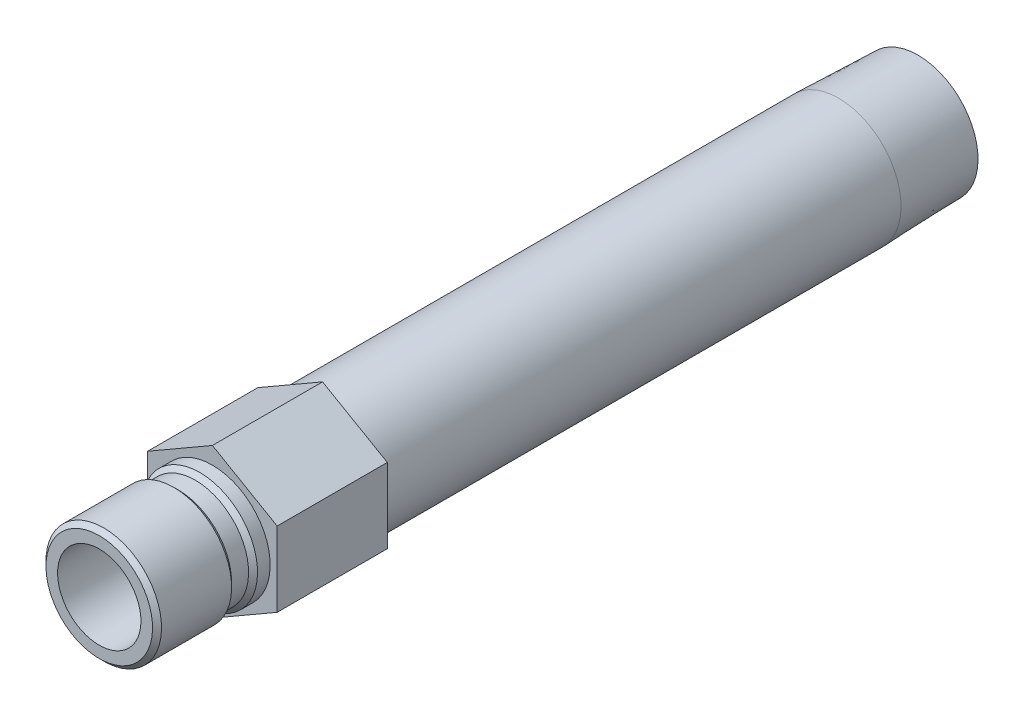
ISO-10303-21;
HEADER;
FILE_DESCRIPTION(('STEP AP214'),'2;1');
FILE_NAME('part.step','',(''),(''),'','','');
FILE_SCHEMA(('AUTOMOTIVE_DESIGN { 1 0 10303 214 1 1 1 1 }'));
ENDSEC;
DATA;
#1=APPLICATION_CONTEXT('core data for automotive mechanical design processes');
#2=APPLICATION_PROTOCOL_DEFINITION('international standard','automotive_design',2000,#1);
#3=PRODUCT_CONTEXT('',#1,'mechanical');
#4=PRODUCT('Part','Part','',(#3));
#5=PRODUCT_RELATED_PRODUCT_CATEGORY('part','',(#4));
#6=PRODUCT_DEFINITION_FORMATION('','',#4);
#7=PRODUCT_DEFINITION_CONTEXT('part definition',#1,'design');
#8=PRODUCT_DEFINITION('design','',#6,#7);
#9=PRODUCT_DEFINITION_SHAPE('','',#8);
#10=(LENGTH_UNIT() NAMED_UNIT(*) SI_UNIT(.MILLI.,.METRE.));
#11=(NAMED_UNIT(*) PLANE_ANGLE_UNIT() SI_UNIT($,.RADIAN.));
#12=(NAMED_UNIT(*) SI_UNIT($,.STERADIAN.) SOLID_ANGLE_UNIT());
#13=UNCERTAINTY_MEASURE_WITH_UNIT(LENGTH_MEASURE(1.E-05),#10,'distance_accuracy_value','');
#14=(GEOMETRIC_REPRESENTATION_CONTEXT(3) GLOBAL_UNCERTAINTY_ASSIGNED_CONTEXT((#13)) GLOBAL_UNIT_ASSIGNED_CONTEXT((#10,
#11,#12)) REPRESENTATION_CONTEXT('',''));
#15=CARTESIAN_POINT('',(0.,0.,0.));
#16=DIRECTION('',(0.,0.,1.));
#17=DIRECTION('',(1.,0.,0.));
#18=AXIS2_PLACEMENT_3D('',#15,#16,#17);
#19=CARTESIAN_POINT('',(0.,0.,0.));
#20=DIRECTION('',(0.,0.,-1.));
#21=DIRECTION('',(0.,1.,0.));
#22=AXIS2_PLACEMENT_3D('',#19,#20,#21);
#23=CYLINDRICAL_SURFACE('',#22,7.112);
#24=CARTESIAN_POINT('',(0.,0.,1.524));
#25=DIRECTION('',(0.,0.,-1.));
#26=DIRECTION('',(0.,1.,0.));
#27=AXIS2_PLACEMENT_3D('',#24,#25,#26);
#28=CIRCLE('',#27,7.112);
#29=CARTESIAN_POINT('',(0.,7.112,1.524));
#30=VERTEX_POINT('',#29);
#31=EDGE_CURVE('E147',#30,#30,#28,.T.);
#32=ORIENTED_EDGE('',*,*,#31,.T.);
#33=EDGE_LOOP('',(#32));
#34=FACE_BOUND('',#33,.T.);
#35=CARTESIAN_POINT('',(0.,0.,19.304));
#36=DIRECTION('',(0.,0.,-1.));
#37=DIRECTION('',(0.,1.,0.));
#38=AXIS2_PLACEMENT_3D('',#35,#36,#37);
#39=CIRCLE('',#38,7.112);
#40=CARTESIAN_POINT('',(0.,7.112,19.304));
#41=VERTEX_POINT('',#40);
#42=EDGE_CURVE('E42',#41,#41,#39,.T.);
#43=ORIENTED_EDGE('',*,*,#42,.F.);
#44=EDGE_LOOP('',(#43));
#45=FACE_BOUND('',#44,.T.);
#46=ADVANCED_FACE('F33',(#34,#45),#23,.F.);
#47=CARTESIAN_POINT('',(0.,7.112,19.304));
#48=DIRECTION('',(0.,0.,1.));
#49=DIRECTION('',(0.,-1.,0.));
#50=AXIS2_PLACEMENT_3D('',#47,#48,#49);
#51=PLANE('',#50);
#52=ORIENTED_EDGE('',*,*,#42,.T.);
#53=EDGE_LOOP('',(#52));
#54=FACE_BOUND('',#53,.T.);
#55=CARTESIAN_POINT('',(0.,0.,19.304));
#56=DIRECTION('',(0.,0.,-1.));
#57=DIRECTION('',(0.,1.,0.));
#58=AXIS2_PLACEMENT_3D('',#55,#56,#57);
#59=CIRCLE('',#58,9.0932);
#60=CARTESIAN_POINT('',(0.,9.0932,19.304));
#61=VERTEX_POINT('',#60);
#62=EDGE_CURVE('E180',#61,#61,#59,.T.);
#63=ORIENTED_EDGE('',*,*,#62,.F.);
#64=EDGE_LOOP('',(#63));
#65=FACE_BOUND('',#64,.T.);
#66=ADVANCED_FACE('F186',(#54,#65),#51,.T.);
#67=CARTESIAN_POINT('',(0.,0.,18.542));
#68=DIRECTION('',(0.,0.,-1.));
#69=DIRECTION('',(0.,1.,0.));
#70=AXIS2_PLACEMENT_3D('',#67,#68,#69);
#71=CONICAL_SURFACE('',#70,9.8552,0.785398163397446);
#72=ORIENTED_EDGE('',*,*,#62,.T.);
#73=EDGE_LOOP('',(#72));
#74=FACE_BOUND('',#73,.T.);
#75=CARTESIAN_POINT('',(0.,0.,18.542));
#76=DIRECTION('',(0.,0.,-1.));
#77=DIRECTION('',(0.,1.,0.));
#78=AXIS2_PLACEMENT_3D('',#75,#76,#77);
#79=CIRCLE('',#78,9.8552);
#80=CARTESIAN_POINT('',(0.,9.8552,18.542));
#81=VERTEX_POINT('',#80);
#82=EDGE_CURVE('E177',#81,#81,#79,.T.);
#83=ORIENTED_EDGE('',*,*,#82,.F.);
#84=EDGE_LOOP('',(#83));
#85=FACE_BOUND('',#84,.T.);
#86=ADVANCED_FACE('F194',(#74,#85),#71,.T.);
#87=CARTESIAN_POINT('',(0.,0.,0.));
#88=DIRECTION('',(0.,0.,-1.));
#89=DIRECTION('',(0.,1.,0.));
#90=AXIS2_PLACEMENT_3D('',#87,#88,#89);
#91=CYLINDRICAL_SURFACE('',#90,9.8552);
#92=ORIENTED_EDGE('',*,*,#82,.T.);
#93=EDGE_LOOP('',(#92));
#94=FACE_BOUND('',#93,.T.);
#95=CARTESIAN_POINT('',(0.,0.,6.5786));
#96=DIRECTION('',(0.,0.,-1.));
#97=DIRECTION('',(0.,1.,0.));
#98=AXIS2_PLACEMENT_3D('',#95,#96,#97);
#99=CIRCLE('',#98,9.8552);
#100=CARTESIAN_POINT('',(0.,9.8552,6.5786));
#101=VERTEX_POINT('',#100);
#102=EDGE_CURVE('E174',#101,#101,#99,.T.);
#103=ORIENTED_EDGE('',*,*,#102,.F.);
#104=EDGE_LOOP('',(#103));
#105=FACE_BOUND('',#104,.T.);
#106=ADVANCED_FACE('F249',(#94,#105),#91,.T.);
#107=CARTESIAN_POINT('',(0.,0.,5.8166));
#108=DIRECTION('',(0.,0.,1.));
#109=DIRECTION('',(0.,-1.,0.));
#110=AXIS2_PLACEMENT_3D('',#107,#108,#109);
#111=CONICAL_SURFACE('',#110,9.0932,0.785398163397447);
#112=ORIENTED_EDGE('',*,*,#102,.T.);
#113=EDGE_LOOP('',(#112));
#114=FACE_BOUND('',#113,.T.);
#115=CARTESIAN_POINT('',(0.,0.,5.8166));
#116=DIRECTION('',(0.,0.,-1.));
#117=DIRECTION('',(0.,1.,0.));
#118=AXIS2_PLACEMENT_3D('',#115,#116,#117);
#119=CIRCLE('',#118,9.0932);
#120=CARTESIAN_POINT('',(0.,9.0932,5.8166));
#121=VERTEX_POINT('',#120);
#122=EDGE_CURVE('E171',#121,#121,#119,.T.);
#123=ORIENTED_EDGE('',*,*,#122,.F.);
#124=EDGE_LOOP('',(#123));
#125=FACE_BOUND('',#124,.T.);
#126=ADVANCED_FACE('F245',(#114,#125),#111,.T.);
#127=CARTESIAN_POINT('',(0.,0.,0.));
#128=DIRECTION('',(0.,0.,-1.));
#129=DIRECTION('',(0.,1.,0.));
#130=AXIS2_PLACEMENT_3D('',#127,#128,#129);
#131=CYLINDRICAL_SURFACE('',#130,9.0932);
#132=ORIENTED_EDGE('',*,*,#122,.T.);
#133=EDGE_LOOP('',(#132));
#134=FACE_BOUND('',#133,.T.);
#135=CARTESIAN_POINT('',(0.,0.,2.921));
#136=DIRECTION('',(0.,0.,-1.));
#137=DIRECTION('',(0.,1.,0.));
#138=AXIS2_PLACEMENT_3D('',#135,#136,#137);
#139=CIRCLE('',#138,9.0932);
#140=CARTESIAN_POINT('',(0.,9.0932,2.921));
#141=VERTEX_POINT('',#140);
#142=EDGE_CURVE('E168',#141,#141,#139,.T.);
#143=ORIENTED_EDGE('',*,*,#142,.F.);
#144=EDGE_LOOP('',(#143));
#145=FACE_BOUND('',#144,.T.);
#146=ADVANCED_FACE('F241',(#134,#145),#131,.T.);
#147=CARTESIAN_POINT('',(0.,0.,2.159));
#148=DIRECTION('',(0.,0.,-1.));
#149=DIRECTION('',(0.,1.,0.));
#150=AXIS2_PLACEMENT_3D('',#147,#148,#149);
#151=CONICAL_SURFACE('',#150,9.8552,0.785398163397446);
#152=ORIENTED_EDGE('',*,*,#142,.T.);
#153=EDGE_LOOP('',(#152));
#154=FACE_BOUND('',#153,.T.);
#155=CARTESIAN_POINT('',(0.,0.,2.159));
#156=DIRECTION('',(0.,0.,-1.));
#157=DIRECTION('',(0.,1.,0.));
#158=AXIS2_PLACEMENT_3D('',#155,#156,#157);
#159=CIRCLE('',#158,9.8552);
#160=CARTESIAN_POINT('',(0.,9.8552,2.159));
#161=VERTEX_POINT('',#160);
#162=EDGE_CURVE('E165',#161,#161,#159,.T.);
#163=ORIENTED_EDGE('',*,*,#162,.F.);
#164=EDGE_LOOP('',(#163));
#165=FACE_BOUND('',#164,.T.);
#166=ADVANCED_FACE('F237',(#154,#165),#151,.T.);
#167=CARTESIAN_POINT('',(0.,0.,0.));
#168=DIRECTION('',(0.,0.,-1.));
#169=DIRECTION('',(0.,1.,0.));
#170=AXIS2_PLACEMENT_3D('',#167,#168,#169);
#171=CYLINDRICAL_SURFACE('',#170,9.8552);
#172=ORIENTED_EDGE('',*,*,#162,.T.);
#173=EDGE_LOOP('',(#172));
#174=FACE_BOUND('',#173,.T.);
#175=CARTESIAN_POINT('',(0.,0.,0.));
#176=DIRECTION('',(0.,0.,-1.));
#177=DIRECTION('',(0.,1.,0.));
#178=AXIS2_PLACEMENT_3D('',#175,#176,#177);
#179=CIRCLE('',#178,9.8552);
#180=CARTESIAN_POINT('',(0.,9.8552,0.));
#181=VERTEX_POINT('',#180);
#182=EDGE_CURVE('E162',#181,#181,#179,.T.);
#183=ORIENTED_EDGE('',*,*,#182,.F.);
#184=EDGE_LOOP('',(#183));
#185=FACE_BOUND('',#184,.T.);
#186=ADVANCED_FACE('F233',(#174,#185),#171,.T.);
#187=CARTESIAN_POINT('',(0.,9.8552,0.));
#188=DIRECTION('',(0.,0.,1.));
#189=DIRECTION('',(0.,-1.,0.));
#190=AXIS2_PLACEMENT_3D('',#187,#188,#189);
#191=PLANE('',#190);
#192=ORIENTED_EDGE('',*,*,#182,.T.);
#193=EDGE_LOOP('',(#192));
#194=FACE_BOUND('',#193,.T.);
#195=DIRECTION('',(-0.866025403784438,-0.5,0.));
#196=VECTOR('',#195,1.);
#197=CARTESIAN_POINT('',(0.,12.7582862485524,0.));
#198=LINE('',#197,#196);
#199=CARTESIAN_POINT('',(0.,12.7582862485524,0.));
#200=VERTEX_POINT('',#199);
#201=CARTESIAN_POINT('',(-11.049,6.37914312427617,0.));
#202=VERTEX_POINT('',#201);
#203=EDGE_CURVE('E121',#200,#202,#198,.T.);
#204=ORIENTED_EDGE('',*,*,#203,.T.);
#205=DIRECTION('',(0.,-1.,0.));
#206=VECTOR('',#205,1.);
#207=CARTESIAN_POINT('',(-11.049,6.37914312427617,0.));
#208=LINE('',#207,#206);
#209=CARTESIAN_POINT('',(-11.049,-6.37914312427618,0.));
#210=VERTEX_POINT('',#209);
#211=EDGE_CURVE('E124',#202,#210,#208,.T.);
#212=ORIENTED_EDGE('',*,*,#211,.T.);
#213=DIRECTION('',(0.866025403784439,-0.5,0.));
#214=VECTOR('',#213,1.);
#215=CARTESIAN_POINT('',(-11.049,-6.37914312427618,0.));
#216=LINE('',#215,#214);
#217=CARTESIAN_POINT('',(0.,-12.7582862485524,0.));
#218=VERTEX_POINT('',#217);
#219=EDGE_CURVE('E128',#210,#218,#216,.T.);
#220=ORIENTED_EDGE('',*,*,#219,.T.);
#221=DIRECTION('',(0.866025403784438,0.5,0.));
#222=VECTOR('',#221,1.);
#223=CARTESIAN_POINT('',(0.,-12.7582862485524,0.));
#224=LINE('',#223,#222);
#225=CARTESIAN_POINT('',(11.049,-6.37914312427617,0.));
#226=VERTEX_POINT('',#225);
#227=EDGE_CURVE('E131',#218,#226,#224,.T.);
#228=ORIENTED_EDGE('',*,*,#227,.T.);
#229=DIRECTION('',(0.,1.,0.));
#230=VECTOR('',#229,1.);
#231=CARTESIAN_POINT('',(11.049,-6.37914312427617,0.));
#232=LINE('',#231,#230);
#233=CARTESIAN_POINT('',(11.049,6.37914312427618,0.));
#234=VERTEX_POINT('',#233);
#235=EDGE_CURVE('E98',#226,#234,#232,.T.);
#236=ORIENTED_EDGE('',*,*,#235,.T.);
#237=DIRECTION('',(-0.866025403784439,0.5,0.));
#238=VECTOR('',#237,1.);
#239=CARTESIAN_POINT('',(11.049,6.37914312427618,0.));
#240=LINE('',#239,#238);
#241=EDGE_CURVE('E134',#234,#200,#240,.T.);
#242=ORIENTED_EDGE('',*,*,#241,.T.);
#243=EDGE_LOOP('',(#204,#212,#220,#228,#236,#242));
#244=FACE_BOUND('',#243,.T.);
#245=ADVANCED_FACE('F210',(#194,#244),#191,.T.);
#246=CARTESIAN_POINT('',(0.,0.,0.));
#247=DIRECTION('',(0.,0.,-1.));
#248=DIRECTION('',(0.,1.,0.));
#249=AXIS2_PLACEMENT_3D('',#246,#247,#248);
#250=CYLINDRICAL_SURFACE('',#249,7.89939999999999);
#251=CARTESIAN_POINT('',(0.,0.,0.));
#252=DIRECTION('',(0.,0.,1.));
#253=DIRECTION('',(1.,0.,0.));
#254=AXIS2_PLACEMENT_3D('',#251,#252,#253);
#255=CIRCLE('',#254,7.89939999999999);
#256=CARTESIAN_POINT('',(7.89939999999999,0.,0.));
#257=VERTEX_POINT('',#256);
#258=EDGE_CURVE('E11',#257,#257,#255,.T.);
#259=ORIENTED_EDGE('',*,*,#258,.F.);
#260=EDGE_LOOP('',(#259));
#261=FACE_BOUND('',#260,.T.);
#262=CARTESIAN_POINT('',(0.,0.,1.10533199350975));
#263=DIRECTION('',(0.,0.,-1.));
#264=DIRECTION('',(0.,1.,0.));
#265=AXIS2_PLACEMENT_3D('',#262,#263,#264);
#266=CIRCLE('',#265,7.8994);
#267=CARTESIAN_POINT('',(0.,7.8994,1.10533199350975));
#268=VERTEX_POINT('',#267);
#269=EDGE_CURVE('E150',#268,#268,#266,.T.);
#270=ORIENTED_EDGE('',*,*,#269,.F.);
#271=EDGE_LOOP('',(#270));
#272=FACE_BOUND('',#271,.T.);
#273=ADVANCED_FACE('F200',(#261,#272),#250,.F.);
#274=CARTESIAN_POINT('',(0.,0.,1.524));
#275=DIRECTION('',(0.,0.,-1.));
#276=DIRECTION('',(0.,1.,0.));
#277=AXIS2_PLACEMENT_3D('',#274,#275,#276);
#278=CONICAL_SURFACE('',#277,7.112,1.08210413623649);
#279=ORIENTED_EDGE('',*,*,#269,.T.);
#280=EDGE_LOOP('',(#279));
#281=FACE_BOUND('',#280,.T.);
#282=ORIENTED_EDGE('',*,*,#31,.F.);
#283=EDGE_LOOP('',(#282));
#284=FACE_BOUND('',#283,.T.);
#285=ADVANCED_FACE('F197',(#281,#284),#278,.F.);
#286=CARTESIAN_POINT('',(-11.049,6.37914312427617,-18.796));
#287=DIRECTION('',(0.,0.,1.));
#288=DIRECTION('',(1.,0.,0.));
#289=AXIS2_PLACEMENT_3D('',#286,#287,#288);
#290=PLANE('',#289);
#291=CARTESIAN_POINT('',(0.,0.,-18.796));
#292=DIRECTION('',(0.,0.,1.));
#293=DIRECTION('',(1.,0.,0.));
#294=AXIS2_PLACEMENT_3D('',#291,#292,#293);
#295=CIRCLE('',#294,7.89939999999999);
#296=CARTESIAN_POINT('',(7.89939999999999,0.,-18.796));
#297=VERTEX_POINT('',#296);
#298=EDGE_CURVE('E36',#297,#297,#295,.T.);
#299=ORIENTED_EDGE('',*,*,#298,.F.);
#300=EDGE_LOOP('',(#299));
#301=FACE_BOUND('',#300,.T.);
#302=CARTESIAN_POINT('',(0.,0.,-18.796));
#303=DIRECTION('',(0.,0.,1.));
#304=DIRECTION('',(1.,0.,0.));
#305=AXIS2_PLACEMENT_3D('',#302,#303,#304);
#306=CIRCLE('',#305,7.112);
#307=CARTESIAN_POINT('',(7.112,0.,-18.796));
#308=VERTEX_POINT('',#307);
#309=EDGE_CURVE('E125',#308,#308,#306,.T.);
#310=ORIENTED_EDGE('',*,*,#309,.T.);
#311=EDGE_LOOP('',(#310));
#312=FACE_BOUND('',#311,.T.);
#313=ADVANCED_FACE('F199',(#301,#312),#290,.F.);
#314=CARTESIAN_POINT('',(0.,0.,-18.796));
#315=DIRECTION('',(0.,0.,1.));
#316=DIRECTION('',(1.,0.,0.));
#317=AXIS2_PLACEMENT_3D('',#314,#315,#316);
#318=CYLINDRICAL_SURFACE('',#317,7.112);
#319=ORIENTED_EDGE('',*,*,#309,.F.);
#320=EDGE_LOOP('',(#319));
#321=FACE_BOUND('',#320,.T.);
#322=CARTESIAN_POINT('',(0.,0.,0.));
#323=DIRECTION('',(0.,0.,1.));
#324=DIRECTION('',(1.,0.,0.));
#325=AXIS2_PLACEMENT_3D('',#322,#323,#324);
#326=CIRCLE('',#325,7.112);
#327=CARTESIAN_POINT('',(7.112,0.,0.));
#328=VERTEX_POINT('',#327);
#329=EDGE_CURVE('E443',#328,#328,#326,.T.);
#330=ORIENTED_EDGE('',*,*,#329,.T.);
#331=EDGE_LOOP('',(#330));
#332=FACE_BOUND('',#331,.T.);
#333=ADVANCED_FACE('F207',(#321,#332),#318,.F.);
#334=CARTESIAN_POINT('',(-11.049,6.37914312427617,0.));
#335=DIRECTION('',(0.,0.,1.));
#336=DIRECTION('',(1.,0.,0.));
#337=AXIS2_PLACEMENT_3D('',#334,#335,#336);
#338=PLANE('',#337);
#339=ORIENTED_EDGE('',*,*,#258,.T.);
#340=EDGE_LOOP('',(#339));
#341=FACE_BOUND('',#340,.T.);
#342=ORIENTED_EDGE('',*,*,#329,.F.);
#343=EDGE_LOOP('',(#342));
#344=FACE_BOUND('',#343,.T.);
#345=ADVANCED_FACE('F221',(#341,#344),#338,.T.);
#346=CARTESIAN_POINT('',(0.,10.244140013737,-120.396));
#347=DIRECTION('',(0.,0.,-1.));
#348=DIRECTION('',(0.,1.,0.));
#349=AXIS2_PLACEMENT_3D('',#346,#347,#348);
#350=PLANE('',#349);
#351=CARTESIAN_POINT('',(0.,0.,-120.396));
#352=DIRECTION('',(0.,0.,-1.));
#353=DIRECTION('',(0.,1.,0.));
#354=AXIS2_PLACEMENT_3D('',#351,#352,#353);
#355=CIRCLE('',#354,10.244140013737);
#356=CARTESIAN_POINT('',(0.,10.244140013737,-120.396));
#357=VERTEX_POINT('',#356);
#358=EDGE_CURVE('E156',#357,#357,#355,.T.);
#359=ORIENTED_EDGE('',*,*,#358,.T.);
#360=EDGE_LOOP('',(#359));
#361=FACE_BOUND('',#360,.T.);
#362=CARTESIAN_POINT('',(0.,0.,-120.396));
#363=DIRECTION('',(0.,0.,-1.));
#364=DIRECTION('',(0.,1.,0.));
#365=AXIS2_PLACEMENT_3D('',#362,#363,#364);
#366=CIRCLE('',#365,7.89939999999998);
#367=CARTESIAN_POINT('',(0.,7.8994,-120.396));
#368=VERTEX_POINT('',#367);
#369=EDGE_CURVE('E153',#368,#368,#366,.T.);
#370=ORIENTED_EDGE('',*,*,#369,.F.);
#371=EDGE_LOOP('',(#370));
#372=FACE_BOUND('',#371,.T.);
#373=ADVANCED_FACE('F218',(#361,#372),#350,.T.);
#374=ORIENTED_EDGE('',*,*,#369,.T.);
#375=EDGE_LOOP('',(#374));
#376=FACE_BOUND('',#375,.T.);
#377=ORIENTED_EDGE('',*,*,#298,.T.);
#378=EDGE_LOOP('',(#377));
#379=FACE_BOUND('',#378,.T.);
#380=ADVANCED_FACE('F213',(#376,#379),#250,.F.);
#381=CARTESIAN_POINT('',(0.,0.,-120.396));
#382=DIRECTION('',(0.,0.,1.));
#383=DIRECTION('',(0.,-1.,0.));
#384=AXIS2_PLACEMENT_3D('',#381,#382,#383);
#385=CONICAL_SURFACE('',#384,10.244140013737,0.0312396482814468);
#386=CARTESIAN_POINT('',(0.,0.,-106.8324));
#387=DIRECTION('',(0.,0.,-1.));
#388=DIRECTION('',(0.,1.,0.));
#389=AXIS2_PLACEMENT_3D('',#386,#387,#388);
#390=CIRCLE('',#389,10.668);
#391=CARTESIAN_POINT('',(0.,10.668,-106.8324));
#392=VERTEX_POINT('',#391);
#393=EDGE_CURVE('E159',#392,#392,#390,.T.);
#394=ORIENTED_EDGE('',*,*,#393,.T.);
#395=EDGE_LOOP('',(#394));
#396=FACE_BOUND('',#395,.T.);
#397=ORIENTED_EDGE('',*,*,#358,.F.);
#398=EDGE_LOOP('',(#397));
#399=FACE_BOUND('',#398,.T.);
#400=ADVANCED_FACE('F223',(#396,#399),#385,.T.);
#401=CARTESIAN_POINT('',(0.,0.,0.));
#402=DIRECTION('',(0.,0.,-1.));
#403=DIRECTION('',(0.,1.,0.));
#404=AXIS2_PLACEMENT_3D('',#401,#402,#403);
#405=CYLINDRICAL_SURFACE('',#404,10.668);
#406=ORIENTED_EDGE('',*,*,#393,.F.);
#407=EDGE_LOOP('',(#406));
#408=FACE_BOUND('',#407,.T.);
#409=CARTESIAN_POINT('',(0.,0.,-18.796));
#410=DIRECTION('',(0.,0.,1.));
#411=DIRECTION('',(1.,0.,0.));
#412=AXIS2_PLACEMENT_3D('',#409,#410,#411);
#413=CIRCLE('',#412,10.668);
#414=CARTESIAN_POINT('',(10.668,0.,-18.796));
#415=VERTEX_POINT('',#414);
#416=EDGE_CURVE('E144',#415,#415,#413,.F.);
#417=ORIENTED_EDGE('',*,*,#416,.T.);
#418=EDGE_LOOP('',(#417));
#419=FACE_BOUND('',#418,.T.);
#420=ADVANCED_FACE('F226',(#408,#419),#405,.T.);
#421=ORIENTED_EDGE('',*,*,#416,.F.);
#422=EDGE_LOOP('',(#421));
#423=FACE_BOUND('',#422,.T.);
#424=DIRECTION('',(-0.866025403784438,-0.5,0.));
#425=VECTOR('',#424,1.);
#426=CARTESIAN_POINT('',(0.,12.7582862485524,-18.796));
#427=LINE('',#426,#425);
#428=CARTESIAN_POINT('',(0.,12.7582862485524,-18.796));
#429=VERTEX_POINT('',#428);
#430=CARTESIAN_POINT('',(-11.049,6.37914312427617,-18.796));
#431=VERTEX_POINT('',#430);
#432=EDGE_CURVE('E137',#429,#431,#427,.T.);
#433=ORIENTED_EDGE('',*,*,#432,.F.);
#434=DIRECTION('',(-0.866025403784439,0.5,0.));
#435=VECTOR('',#434,1.);
#436=CARTESIAN_POINT('',(11.049,6.37914312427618,-18.796));
#437=LINE('',#436,#435);
#438=CARTESIAN_POINT('',(11.049,6.37914312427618,-18.796));
#439=VERTEX_POINT('',#438);
#440=EDGE_CURVE('E111',#439,#429,#437,.T.);
#441=ORIENTED_EDGE('',*,*,#440,.F.);
#442=DIRECTION('',(0.,1.,0.));
#443=VECTOR('',#442,1.);
#444=CARTESIAN_POINT('',(11.049,-6.37914312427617,-18.796));
#445=LINE('',#444,#443);
#446=CARTESIAN_POINT('',(11.049,-6.37914312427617,-18.796));
#447=VERTEX_POINT('',#446);
#448=EDGE_CURVE('E96',#447,#439,#445,.T.);
#449=ORIENTED_EDGE('',*,*,#448,.F.);
#450=DIRECTION('',(0.866025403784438,0.5,0.));
#451=VECTOR('',#450,1.);
#452=CARTESIAN_POINT('',(0.,-12.7582862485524,-18.796));
#453=LINE('',#452,#451);
#454=CARTESIAN_POINT('',(0.,-12.7582862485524,-18.796));
#455=VERTEX_POINT('',#454);
#456=EDGE_CURVE('E109',#455,#447,#453,.T.);
#457=ORIENTED_EDGE('',*,*,#456,.F.);
#458=DIRECTION('',(0.866025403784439,-0.5,0.));
#459=VECTOR('',#458,1.);
#460=CARTESIAN_POINT('',(-11.049,-6.37914312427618,-18.796));
#461=LINE('',#460,#459);
#462=CARTESIAN_POINT('',(-11.049,-6.37914312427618,-18.796));
#463=VERTEX_POINT('',#462);
#464=EDGE_CURVE('E114',#463,#455,#461,.T.);
#465=ORIENTED_EDGE('',*,*,#464,.F.);
#466=DIRECTION('',(0.,-1.,0.));
#467=VECTOR('',#466,1.);
#468=CARTESIAN_POINT('',(-11.049,6.37914312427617,-18.796));
#469=LINE('',#468,#467);
#470=EDGE_CURVE('E116',#431,#463,#469,.T.);
#471=ORIENTED_EDGE('',*,*,#470,.F.);
#472=EDGE_LOOP('',(#433,#441,#449,#457,#465,#471));
#473=FACE_BOUND('',#472,.T.);
#474=ADVANCED_FACE('F107',(#423,#473),#290,.F.);
#475=CARTESIAN_POINT('',(0.,12.7582862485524,-18.796));
#476=DIRECTION('',(-0.5,0.866025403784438,0.));
#477=DIRECTION('',(-0.866025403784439,-0.5,0.));
#478=AXIS2_PLACEMENT_3D('',#475,#476,#477);
#479=PLANE('',#478);
#480=ORIENTED_EDGE('',*,*,#203,.F.);
#481=DIRECTION('',(0.,0.,1.));
#482=VECTOR('',#481,1.);
#483=CARTESIAN_POINT('',(0.,12.7582862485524,-18.796));
#484=LINE('',#483,#482);
#485=EDGE_CURVE('E50',#429,#200,#484,.T.);
#486=ORIENTED_EDGE('',*,*,#485,.F.);
#487=ORIENTED_EDGE('',*,*,#432,.T.);
#488=DIRECTION('',(0.,0.,1.));
#489=VECTOR('',#488,1.);
#490=CARTESIAN_POINT('',(-11.049,6.37914312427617,-18.796));
#491=LINE('',#490,#489);
#492=EDGE_CURVE('E85',#431,#202,#491,.T.);
#493=ORIENTED_EDGE('',*,*,#492,.T.);
#494=EDGE_LOOP('',(#480,#486,#487,#493));
#495=FACE_BOUND('',#494,.T.);
#496=ADVANCED_FACE('F215',(#495),#479,.T.);
#497=CARTESIAN_POINT('',(11.049,6.37914312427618,-18.796));
#498=DIRECTION('',(0.5,0.866025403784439,0.));
#499=DIRECTION('',(-0.866025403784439,0.5,0.));
#500=AXIS2_PLACEMENT_3D('',#497,#498,#499);
#501=PLANE('',#500);
#502=ORIENTED_EDGE('',*,*,#241,.F.);
#503=DIRECTION('',(0.,0.,1.));
#504=VECTOR('',#503,1.);
#505=CARTESIAN_POINT('',(11.049,6.37914312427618,-18.796));
#506=LINE('',#505,#504);
#507=EDGE_CURVE('E73',#439,#234,#506,.T.);
#508=ORIENTED_EDGE('',*,*,#507,.F.);
#509=ORIENTED_EDGE('',*,*,#440,.T.);
#510=ORIENTED_EDGE('',*,*,#485,.T.);
#511=EDGE_LOOP('',(#502,#508,#509,#510));
#512=FACE_BOUND('',#511,.T.);
#513=ADVANCED_FACE('F276',(#512),#501,.T.);
#514=CARTESIAN_POINT('',(11.049,-6.37914312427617,-18.796));
#515=DIRECTION('',(1.,0.,0.));
#516=DIRECTION('',(0.,1.,0.));
#517=AXIS2_PLACEMENT_3D('',#514,#515,#516);
#518=PLANE('',#517);
#519=ORIENTED_EDGE('',*,*,#235,.F.);
#520=DIRECTION('',(0.,0.,1.));
#521=VECTOR('',#520,1.);
#522=CARTESIAN_POINT('',(11.049,-6.37914312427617,-18.796));
#523=LINE('',#522,#521);
#524=EDGE_CURVE('E93',#447,#226,#523,.T.);
#525=ORIENTED_EDGE('',*,*,#524,.F.);
#526=ORIENTED_EDGE('',*,*,#448,.T.);
#527=ORIENTED_EDGE('',*,*,#507,.T.);
#528=EDGE_LOOP('',(#519,#525,#526,#527));
#529=FACE_BOUND('',#528,.T.);
#530=ADVANCED_FACE('F95',(#529),#518,.T.);
#531=CARTESIAN_POINT('',(0.,-12.7582862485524,-18.796));
#532=DIRECTION('',(0.5,-0.866025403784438,0.));
#533=DIRECTION('',(0.866025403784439,0.5,0.));
#534=AXIS2_PLACEMENT_3D('',#531,#532,#533);
#535=PLANE('',#534);
#536=ORIENTED_EDGE('',*,*,#227,.F.);
#537=DIRECTION('',(0.,0.,1.));
#538=VECTOR('',#537,1.);
#539=CARTESIAN_POINT('',(0.,-12.7582862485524,-18.796));
#540=LINE('',#539,#538);
#541=EDGE_CURVE('E103',#455,#218,#540,.T.);
#542=ORIENTED_EDGE('',*,*,#541,.F.);
#543=ORIENTED_EDGE('',*,*,#456,.T.);
#544=ORIENTED_EDGE('',*,*,#524,.T.);
#545=EDGE_LOOP('',(#536,#542,#543,#544));
#546=FACE_BOUND('',#545,.T.);
#547=ADVANCED_FACE('F113',(#546),#535,.T.);
#548=CARTESIAN_POINT('',(-11.049,-6.37914312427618,-18.796));
#549=DIRECTION('',(-0.5,-0.866025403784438,0.));
#550=DIRECTION('',(0.866025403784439,-0.5,0.));
#551=AXIS2_PLACEMENT_3D('',#548,#549,#550);
#552=PLANE('',#551);
#553=ORIENTED_EDGE('',*,*,#219,.F.);
#554=DIRECTION('',(0.,0.,1.));
#555=VECTOR('',#554,1.);
#556=CARTESIAN_POINT('',(-11.049,-6.37914312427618,-18.796));
#557=LINE('',#556,#555);
#558=EDGE_CURVE('E141',#463,#210,#557,.T.);
#559=ORIENTED_EDGE('',*,*,#558,.F.);
#560=ORIENTED_EDGE('',*,*,#464,.T.);
#561=ORIENTED_EDGE('',*,*,#541,.T.);
#562=EDGE_LOOP('',(#553,#559,#560,#561));
#563=FACE_BOUND('',#562,.T.);
#564=ADVANCED_FACE('F275',(#563),#552,.T.);
#565=CARTESIAN_POINT('',(-11.049,6.37914312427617,-18.796));
#566=DIRECTION('',(-1.,0.,0.));
#567=DIRECTION('',(0.,0.,1.));
#568=AXIS2_PLACEMENT_3D('',#565,#566,#567);
#569=PLANE('',#568);
#570=ORIENTED_EDGE('',*,*,#211,.F.);
#571=ORIENTED_EDGE('',*,*,#492,.F.);
#572=ORIENTED_EDGE('',*,*,#470,.T.);
#573=ORIENTED_EDGE('',*,*,#558,.T.);
#574=EDGE_LOOP('',(#570,#571,#572,#573));
#575=FACE_BOUND('',#574,.T.);
#576=ADVANCED_FACE('F272',(#575),#569,.T.);
#577=CLOSED_SHELL('',(#46,#66,#86,#106,#126,#146,#166,#186,#245,#273,#285,#313,#333,#345,#373,
#380,#400,#420,#474,#496,#513,#530,#547,#564,#576));
#578=MANIFOLD_SOLID_BREP('B2',#577);
#579=ADVANCED_BREP_SHAPE_REPRESENTATION('',(#18,#578),#14);
#580=SHAPE_DEFINITION_REPRESENTATION(#9,#579);
ENDSEC;
END-ISO-10303-21;
